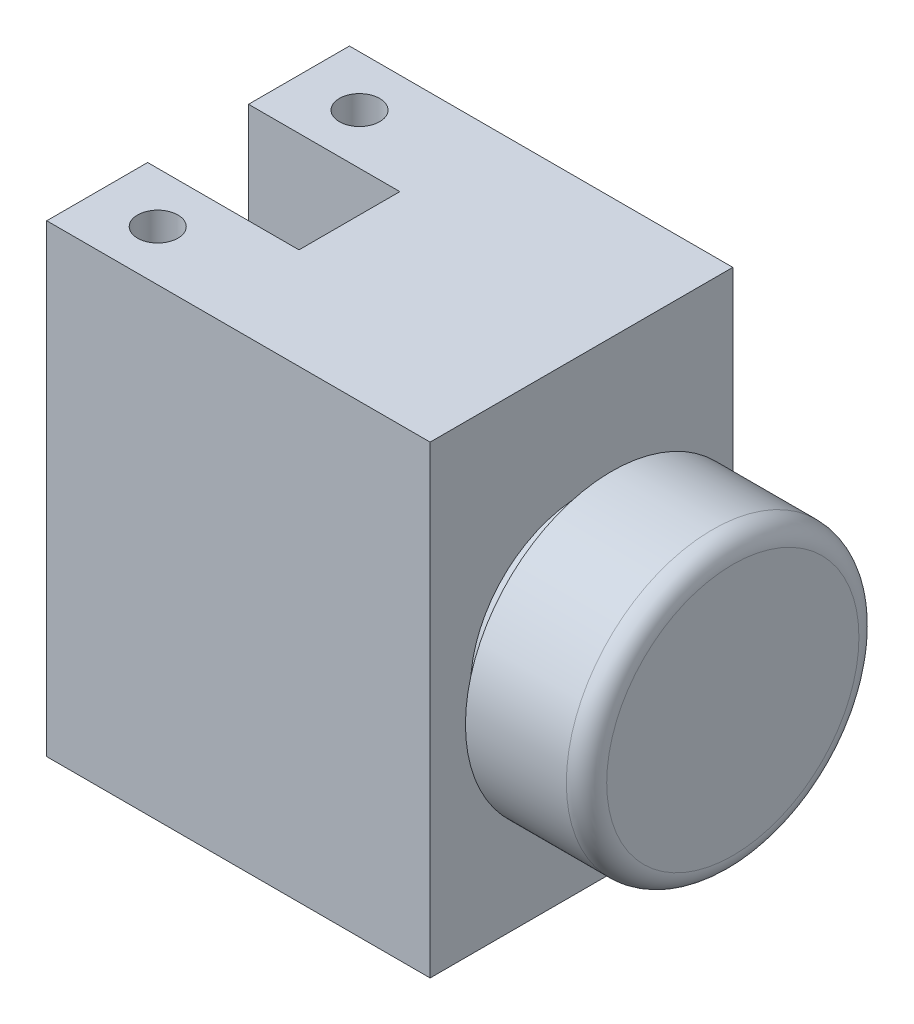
ISO-10303-21;
HEADER;
FILE_DESCRIPTION(('STEP AP214'),'2;1');
FILE_NAME('part.step','',(''),(''),'','','');
FILE_SCHEMA(('AUTOMOTIVE_DESIGN { 1 0 10303 214 1 1 1 1 }'));
ENDSEC;
DATA;
#1=APPLICATION_CONTEXT('core data for automotive mechanical design processes');
#2=APPLICATION_PROTOCOL_DEFINITION('international standard','automotive_design',2000,#1);
#3=PRODUCT_CONTEXT('',#1,'mechanical');
#4=PRODUCT('Part','Part','',(#3));
#5=PRODUCT_RELATED_PRODUCT_CATEGORY('part','',(#4));
#6=PRODUCT_DEFINITION_FORMATION('','',#4);
#7=PRODUCT_DEFINITION_CONTEXT('part definition',#1,'design');
#8=PRODUCT_DEFINITION('design','',#6,#7);
#9=PRODUCT_DEFINITION_SHAPE('','',#8);
#10=(LENGTH_UNIT() NAMED_UNIT(*) SI_UNIT(.MILLI.,.METRE.));
#11=(NAMED_UNIT(*) PLANE_ANGLE_UNIT() SI_UNIT($,.RADIAN.));
#12=(NAMED_UNIT(*) SI_UNIT($,.STERADIAN.) SOLID_ANGLE_UNIT());
#13=UNCERTAINTY_MEASURE_WITH_UNIT(LENGTH_MEASURE(1.E-05),#10,'distance_accuracy_value','');
#14=(GEOMETRIC_REPRESENTATION_CONTEXT(3) GLOBAL_UNCERTAINTY_ASSIGNED_CONTEXT((#13)) GLOBAL_UNIT_ASSIGNED_CONTEXT((#10,
#11,#12)) REPRESENTATION_CONTEXT('',''));
#15=CARTESIAN_POINT('',(0.,0.,0.));
#16=DIRECTION('',(0.,0.,1.));
#17=DIRECTION('',(1.,0.,0.));
#18=AXIS2_PLACEMENT_3D('',#15,#16,#17);
#19=CARTESIAN_POINT('',(12.,0.,0.));
#20=DIRECTION('',(-1.,0.,0.));
#21=DIRECTION('',(0.,0.,1.));
#22=AXIS2_PLACEMENT_3D('',#19,#20,#21);
#23=PLANE('',#22);
#24=CARTESIAN_POINT('',(12.,0.,0.));
#25=DIRECTION('',(-1.,0.,0.));
#26=DIRECTION('',(0.,0.,-1.));
#27=AXIS2_PLACEMENT_3D('',#24,#25,#26);
#28=CIRCLE('',#27,12.5);
#29=CARTESIAN_POINT('',(12.,0.,-12.5));
#30=VERTEX_POINT('',#29);
#31=CARTESIAN_POINT('',(12.,0.,12.5));
#32=VERTEX_POINT('',#31);
#33=EDGE_CURVE('E86',#30,#32,#28,.T.);
#34=ORIENTED_EDGE('',*,*,#33,.F.);
#35=CARTESIAN_POINT('',(12.,0.,0.));
#36=DIRECTION('',(-1.,0.,0.));
#37=DIRECTION('',(0.,0.,1.));
#38=AXIS2_PLACEMENT_3D('',#35,#36,#37);
#39=CIRCLE('',#38,12.5);
#40=EDGE_CURVE('E88',#32,#30,#39,.T.);
#41=ORIENTED_EDGE('',*,*,#40,.F.);
#42=EDGE_LOOP('',(#34,#41));
#43=FACE_BOUND('',#42,.T.);
#44=ADVANCED_FACE('F16',(#43),#23,.F.);
#45=CARTESIAN_POINT('',(10.,0.,0.));
#46=DIRECTION('',(-1.,0.,0.));
#47=DIRECTION('',(0.,0.,1.));
#48=AXIS2_PLACEMENT_3D('',#45,#46,#47);
#49=TOROIDAL_SURFACE('',#48,12.5,2.);
#50=CARTESIAN_POINT('',(10.,0.,0.));
#51=DIRECTION('',(-1.,0.,0.));
#52=DIRECTION('',(0.,0.,1.));
#53=AXIS2_PLACEMENT_3D('',#50,#51,#52);
#54=CIRCLE('',#53,14.5);
#55=CARTESIAN_POINT('',(10.,0.,14.5));
#56=VERTEX_POINT('',#55);
#57=EDGE_CURVE('E93',#56,#56,#54,.T.);
#58=ORIENTED_EDGE('',*,*,#57,.F.);
#59=EDGE_LOOP('',(#58));
#60=FACE_BOUND('',#59,.T.);
#61=ORIENTED_EDGE('',*,*,#40,.T.);
#62=ORIENTED_EDGE('',*,*,#33,.T.);
#63=EDGE_LOOP('',(#61,#62));
#64=FACE_BOUND('',#63,.T.);
#65=ADVANCED_FACE('F90',(#60,#64),#49,.T.);
#66=CARTESIAN_POINT('',(-6.27555773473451,0.,0.));
#67=DIRECTION('',(-1.,0.,0.));
#68=DIRECTION('',(0.,0.,1.));
#69=AXIS2_PLACEMENT_3D('',#66,#67,#68);
#70=CYLINDRICAL_SURFACE('',#69,14.5);
#71=CARTESIAN_POINT('',(0.,0.,0.));
#72=DIRECTION('',(-1.,0.,0.));
#73=DIRECTION('',(0.,0.,1.));
#74=AXIS2_PLACEMENT_3D('',#71,#72,#73);
#75=CIRCLE('',#74,14.5);
#76=CARTESIAN_POINT('',(0.,0.,14.5));
#77=VERTEX_POINT('',#76);
#78=EDGE_CURVE('E155',#77,#77,#75,.F.);
#79=ORIENTED_EDGE('',*,*,#78,.T.);
#80=EDGE_LOOP('',(#79));
#81=FACE_BOUND('',#80,.T.);
#82=ORIENTED_EDGE('',*,*,#57,.T.);
#83=EDGE_LOOP('',(#82));
#84=FACE_BOUND('',#83,.T.);
#85=ADVANCED_FACE('F119',(#81,#84),#70,.T.);
#86=CARTESIAN_POINT('',(0.,14.5,0.));
#87=DIRECTION('',(1.,0.,0.));
#88=DIRECTION('',(0.,0.,-1.));
#89=AXIS2_PLACEMENT_3D('',#86,#87,#88);
#90=PLANE('',#89);
#91=ORIENTED_EDGE('',*,*,#78,.F.);
#92=EDGE_LOOP('',(#91));
#93=FACE_BOUND('',#92,.T.);
#94=CARTESIAN_POINT('',(0.,0.,0.));
#95=DIRECTION('',(-1.,0.,0.));
#96=DIRECTION('',(0.,0.,1.));
#97=AXIS2_PLACEMENT_3D('',#94,#95,#96);
#98=CIRCLE('',#97,11.);
#99=CARTESIAN_POINT('',(0.,0.,11.));
#100=VERTEX_POINT('',#99);
#101=EDGE_CURVE('E151',#100,#100,#98,.T.);
#102=ORIENTED_EDGE('',*,*,#101,.F.);
#103=EDGE_LOOP('',(#102));
#104=FACE_BOUND('',#103,.T.);
#105=ADVANCED_FACE('F166',(#93,#104),#90,.F.);
#106=CARTESIAN_POINT('',(-35.,-23.,10.));
#107=DIRECTION('',(0.,1.,0.));
#108=DIRECTION('',(0.,0.,1.));
#109=AXIS2_PLACEMENT_3D('',#106,#107,#108);
#110=CYLINDRICAL_SURFACE('',#109,2.);
#111=CARTESIAN_POINT('',(-35.,-23.,10.));
#112=DIRECTION('',(0.,1.,0.));
#113=DIRECTION('',(0.,0.,1.));
#114=AXIS2_PLACEMENT_3D('',#111,#112,#113);
#115=CIRCLE('',#114,2.);
#116=CARTESIAN_POINT('',(-35.,-23.,12.));
#117=VERTEX_POINT('',#116);
#118=EDGE_CURVE('E148',#117,#117,#115,.F.);
#119=ORIENTED_EDGE('',*,*,#118,.T.);
#120=EDGE_LOOP('',(#119));
#121=FACE_BOUND('',#120,.T.);
#122=CARTESIAN_POINT('',(-35.,23.,10.));
#123=DIRECTION('',(0.,1.,0.));
#124=DIRECTION('',(0.,0.,1.));
#125=AXIS2_PLACEMENT_3D('',#122,#123,#124);
#126=CIRCLE('',#125,2.);
#127=CARTESIAN_POINT('',(-35.,23.,12.));
#128=VERTEX_POINT('',#127);
#129=EDGE_CURVE('E140',#128,#128,#126,.T.);
#130=ORIENTED_EDGE('',*,*,#129,.T.);
#131=EDGE_LOOP('',(#130));
#132=FACE_BOUND('',#131,.T.);
#133=ADVANCED_FACE('F171',(#121,#132),#110,.F.);
#134=CARTESIAN_POINT('',(-35.,-23.,-10.));
#135=DIRECTION('',(0.,1.,0.));
#136=DIRECTION('',(0.,0.,1.));
#137=AXIS2_PLACEMENT_3D('',#134,#135,#136);
#138=CYLINDRICAL_SURFACE('',#137,2.);
#139=CARTESIAN_POINT('',(-35.,-23.,-10.));
#140=DIRECTION('',(0.,1.,0.));
#141=DIRECTION('',(0.,0.,1.));
#142=AXIS2_PLACEMENT_3D('',#139,#140,#141);
#143=CIRCLE('',#142,2.);
#144=CARTESIAN_POINT('',(-35.,-23.,-8.));
#145=VERTEX_POINT('',#144);
#146=EDGE_CURVE('E144',#145,#145,#143,.F.);
#147=ORIENTED_EDGE('',*,*,#146,.T.);
#148=EDGE_LOOP('',(#147));
#149=FACE_BOUND('',#148,.T.);
#150=CARTESIAN_POINT('',(-35.,23.,-10.));
#151=DIRECTION('',(0.,1.,0.));
#152=DIRECTION('',(0.,0.,1.));
#153=AXIS2_PLACEMENT_3D('',#150,#151,#152);
#154=CIRCLE('',#153,2.);
#155=CARTESIAN_POINT('',(-35.,23.,-8.));
#156=VERTEX_POINT('',#155);
#157=EDGE_CURVE('E136',#156,#156,#154,.T.);
#158=ORIENTED_EDGE('',*,*,#157,.T.);
#159=EDGE_LOOP('',(#158));
#160=FACE_BOUND('',#159,.T.);
#161=ADVANCED_FACE('F220',(#149,#160),#138,.F.);
#162=CARTESIAN_POINT('',(-41.,-23.,5.));
#163=DIRECTION('',(0.,0.,1.));
#164=DIRECTION('',(1.,0.,0.));
#165=AXIS2_PLACEMENT_3D('',#162,#163,#164);
#166=PLANE('',#165);
#167=DIRECTION('',(0.,1.,0.));
#168=VECTOR('',#167,1.);
#169=CARTESIAN_POINT('',(-26.,-23.,5.));
#170=LINE('',#169,#168);
#171=CARTESIAN_POINT('',(-26.,23.,5.));
#172=VERTEX_POINT('',#171);
#173=CARTESIAN_POINT('',(-26.,-23.,5.));
#174=VERTEX_POINT('',#173);
#175=EDGE_CURVE('E157',#172,#174,#170,.F.);
#176=ORIENTED_EDGE('',*,*,#175,.T.);
#177=DIRECTION('',(1.,0.,0.));
#178=VECTOR('',#177,1.);
#179=CARTESIAN_POINT('',(-41.,-23.,5.));
#180=LINE('',#179,#178);
#181=CARTESIAN_POINT('',(-41.,-23.,5.));
#182=VERTEX_POINT('',#181);
#183=EDGE_CURVE('E147',#174,#182,#180,.F.);
#184=ORIENTED_EDGE('',*,*,#183,.T.);
#185=DIRECTION('',(0.,1.,0.));
#186=VECTOR('',#185,1.);
#187=CARTESIAN_POINT('',(-41.,-23.,5.));
#188=LINE('',#187,#186);
#189=CARTESIAN_POINT('',(-41.,23.,5.));
#190=VERTEX_POINT('',#189);
#191=EDGE_CURVE('E394',#190,#182,#188,.F.);
#192=ORIENTED_EDGE('',*,*,#191,.F.);
#193=DIRECTION('',(1.,0.,0.));
#194=VECTOR('',#193,1.);
#195=CARTESIAN_POINT('',(-41.,23.,5.));
#196=LINE('',#195,#194);
#197=EDGE_CURVE('E387',#190,#172,#196,.T.);
#198=ORIENTED_EDGE('',*,*,#197,.T.);
#199=EDGE_LOOP('',(#176,#184,#192,#198));
#200=FACE_BOUND('',#199,.T.);
#201=ADVANCED_FACE('F216',(#200),#166,.F.);
#202=CARTESIAN_POINT('',(-26.,-23.,-5.));
#203=DIRECTION('',(1.,0.,0.));
#204=DIRECTION('',(0.,0.,-1.));
#205=AXIS2_PLACEMENT_3D('',#202,#203,#204);
#206=PLANE('',#205);
#207=DIRECTION('',(0.,1.,0.));
#208=VECTOR('',#207,1.);
#209=CARTESIAN_POINT('',(-26.,-23.,-5.));
#210=LINE('',#209,#208);
#211=CARTESIAN_POINT('',(-26.,23.,-5.));
#212=VERTEX_POINT('',#211);
#213=CARTESIAN_POINT('',(-26.,-23.,-5.));
#214=VERTEX_POINT('',#213);
#215=EDGE_CURVE('E161',#212,#214,#210,.F.);
#216=ORIENTED_EDGE('',*,*,#215,.T.);
#217=DIRECTION('',(0.,0.,1.));
#218=VECTOR('',#217,1.);
#219=CARTESIAN_POINT('',(-26.,-23.,-15.));
#220=LINE('',#219,#218);
#221=EDGE_CURVE('E391',#214,#174,#220,.T.);
#222=ORIENTED_EDGE('',*,*,#221,.T.);
#223=ORIENTED_EDGE('',*,*,#175,.F.);
#224=DIRECTION('',(0.,0.,-1.));
#225=VECTOR('',#224,1.);
#226=CARTESIAN_POINT('',(-26.,23.,-15.));
#227=LINE('',#226,#225);
#228=EDGE_CURVE('E420',#172,#212,#227,.T.);
#229=ORIENTED_EDGE('',*,*,#228,.T.);
#230=EDGE_LOOP('',(#216,#222,#223,#229));
#231=FACE_BOUND('',#230,.T.);
#232=ADVANCED_FACE('F212',(#231),#206,.F.);
#233=CARTESIAN_POINT('',(-41.,-23.,-5.));
#234=DIRECTION('',(0.,0.,-1.));
#235=DIRECTION('',(-1.,0.,0.));
#236=AXIS2_PLACEMENT_3D('',#233,#234,#235);
#237=PLANE('',#236);
#238=DIRECTION('',(0.,1.,0.));
#239=VECTOR('',#238,1.);
#240=CARTESIAN_POINT('',(-41.,-23.,-5.));
#241=LINE('',#240,#239);
#242=CARTESIAN_POINT('',(-41.,-23.,-5.));
#243=VERTEX_POINT('',#242);
#244=CARTESIAN_POINT('',(-41.,23.,-5.));
#245=VERTEX_POINT('',#244);
#246=EDGE_CURVE('E409',#243,#245,#241,.T.);
#247=ORIENTED_EDGE('',*,*,#246,.F.);
#248=DIRECTION('',(1.,0.,0.));
#249=VECTOR('',#248,1.);
#250=CARTESIAN_POINT('',(-41.,-23.,-5.));
#251=LINE('',#250,#249);
#252=EDGE_CURVE('E395',#243,#214,#251,.T.);
#253=ORIENTED_EDGE('',*,*,#252,.T.);
#254=ORIENTED_EDGE('',*,*,#215,.F.);
#255=DIRECTION('',(1.,0.,0.));
#256=VECTOR('',#255,1.);
#257=CARTESIAN_POINT('',(-41.,23.,-5.));
#258=LINE('',#257,#256);
#259=EDGE_CURVE('E418',#212,#245,#258,.F.);
#260=ORIENTED_EDGE('',*,*,#259,.T.);
#261=EDGE_LOOP('',(#247,#253,#254,#260));
#262=FACE_BOUND('',#261,.T.);
#263=ADVANCED_FACE('F208',(#262),#237,.F.);
#264=CARTESIAN_POINT('',(-41.,-23.,15.));
#265=DIRECTION('',(-1.,0.,0.));
#266=DIRECTION('',(0.,0.,1.));
#267=AXIS2_PLACEMENT_3D('',#264,#265,#266);
#268=PLANE('',#267);
#269=DIRECTION('',(0.,-1.,0.));
#270=VECTOR('',#269,1.);
#271=CARTESIAN_POINT('',(-41.,23.,-15.));
#272=LINE('',#271,#270);
#273=CARTESIAN_POINT('',(-41.,23.,-15.));
#274=VERTEX_POINT('',#273);
#275=CARTESIAN_POINT('',(-41.,-23.,-15.));
#276=VERTEX_POINT('',#275);
#277=EDGE_CURVE('E154',#274,#276,#272,.T.);
#278=ORIENTED_EDGE('',*,*,#277,.T.);
#279=DIRECTION('',(0.,0.,1.));
#280=VECTOR('',#279,1.);
#281=CARTESIAN_POINT('',(-41.,-23.,-15.));
#282=LINE('',#281,#280);
#283=EDGE_CURVE('E398',#276,#243,#282,.T.);
#284=ORIENTED_EDGE('',*,*,#283,.T.);
#285=ORIENTED_EDGE('',*,*,#246,.T.);
#286=DIRECTION('',(0.,0.,-1.));
#287=VECTOR('',#286,1.);
#288=CARTESIAN_POINT('',(-41.,23.,-15.));
#289=LINE('',#288,#287);
#290=EDGE_CURVE('E413',#245,#274,#289,.T.);
#291=ORIENTED_EDGE('',*,*,#290,.T.);
#292=EDGE_LOOP('',(#278,#284,#285,#291));
#293=FACE_BOUND('',#292,.T.);
#294=ADVANCED_FACE('F204',(#293),#268,.T.);
#295=CARTESIAN_POINT('',(-41.,23.,-15.));
#296=DIRECTION('',(0.,0.,1.));
#297=DIRECTION('',(0.,-1.,0.));
#298=AXIS2_PLACEMENT_3D('',#295,#296,#297);
#299=PLANE('',#298);
#300=DIRECTION('',(1.,0.,0.));
#301=VECTOR('',#300,1.);
#302=CARTESIAN_POINT('',(-41.,-23.,-15.));
#303=LINE('',#302,#301);
#304=CARTESIAN_POINT('',(-3.,-23.,-15.));
#305=VERTEX_POINT('',#304);
#306=EDGE_CURVE('E404',#305,#276,#303,.F.);
#307=ORIENTED_EDGE('',*,*,#306,.T.);
#308=ORIENTED_EDGE('',*,*,#277,.F.);
#309=DIRECTION('',(1.,0.,0.));
#310=VECTOR('',#309,1.);
#311=CARTESIAN_POINT('',(-41.,23.,-15.));
#312=LINE('',#311,#310);
#313=CARTESIAN_POINT('',(-3.,23.,-15.));
#314=VERTEX_POINT('',#313);
#315=EDGE_CURVE('E139',#274,#314,#312,.T.);
#316=ORIENTED_EDGE('',*,*,#315,.T.);
#317=DIRECTION('',(0.,1.,0.));
#318=VECTOR('',#317,1.);
#319=CARTESIAN_POINT('',(-3.,-23.,-15.));
#320=LINE('',#319,#318);
#321=EDGE_CURVE('E441',#314,#305,#320,.F.);
#322=ORIENTED_EDGE('',*,*,#321,.T.);
#323=EDGE_LOOP('',(#307,#308,#316,#322));
#324=FACE_BOUND('',#323,.T.);
#325=ADVANCED_FACE('F200',(#324),#299,.F.);
#326=CARTESIAN_POINT('',(-6.27555773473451,0.,0.));
#327=DIRECTION('',(-1.,0.,0.));
#328=DIRECTION('',(0.,0.,1.));
#329=AXIS2_PLACEMENT_3D('',#326,#327,#328);
#330=CYLINDRICAL_SURFACE('',#329,11.);
#331=CARTESIAN_POINT('',(-3.,0.,0.));
#332=DIRECTION('',(-1.,0.,0.));
#333=DIRECTION('',(0.,0.,1.));
#334=AXIS2_PLACEMENT_3D('',#331,#332,#333);
#335=CIRCLE('',#334,11.);
#336=CARTESIAN_POINT('',(-3.,0.,11.));
#337=VERTEX_POINT('',#336);
#338=EDGE_CURVE('E126',#337,#337,#335,.F.);
#339=ORIENTED_EDGE('',*,*,#338,.T.);
#340=EDGE_LOOP('',(#339));
#341=FACE_BOUND('',#340,.T.);
#342=ORIENTED_EDGE('',*,*,#101,.T.);
#343=EDGE_LOOP('',(#342));
#344=FACE_BOUND('',#343,.T.);
#345=ADVANCED_FACE('F196',(#341,#344),#330,.T.);
#346=CARTESIAN_POINT('',(-41.,-23.,-15.));
#347=DIRECTION('',(0.,1.,0.));
#348=DIRECTION('',(0.,0.,1.));
#349=AXIS2_PLACEMENT_3D('',#346,#347,#348);
#350=PLANE('',#349);
#351=ORIENTED_EDGE('',*,*,#252,.F.);
#352=ORIENTED_EDGE('',*,*,#283,.F.);
#353=ORIENTED_EDGE('',*,*,#306,.F.);
#354=DIRECTION('',(0.,0.,1.));
#355=VECTOR('',#354,1.);
#356=CARTESIAN_POINT('',(-3.,-23.,15.));
#357=LINE('',#356,#355);
#358=CARTESIAN_POINT('',(-3.,-23.,15.));
#359=VERTEX_POINT('',#358);
#360=EDGE_CURVE('E135',#305,#359,#357,.T.);
#361=ORIENTED_EDGE('',*,*,#360,.T.);
#362=DIRECTION('',(1.,0.,0.));
#363=VECTOR('',#362,1.);
#364=CARTESIAN_POINT('',(-41.,-23.,15.));
#365=LINE('',#364,#363);
#366=CARTESIAN_POINT('',(-41.,-23.,15.));
#367=VERTEX_POINT('',#366);
#368=EDGE_CURVE('E134',#359,#367,#365,.F.);
#369=ORIENTED_EDGE('',*,*,#368,.T.);
#370=DIRECTION('',(0.,0.,1.));
#371=VECTOR('',#370,1.);
#372=CARTESIAN_POINT('',(-41.,-23.,15.));
#373=LINE('',#372,#371);
#374=EDGE_CURVE('E143',#182,#367,#373,.T.);
#375=ORIENTED_EDGE('',*,*,#374,.F.);
#376=ORIENTED_EDGE('',*,*,#183,.F.);
#377=ORIENTED_EDGE('',*,*,#221,.F.);
#378=EDGE_LOOP('',(#351,#352,#353,#361,#369,#375,#376,#377));
#379=FACE_BOUND('',#378,.T.);
#380=ORIENTED_EDGE('',*,*,#146,.F.);
#381=EDGE_LOOP('',(#380));
#382=FACE_BOUND('',#381,.T.);
#383=ORIENTED_EDGE('',*,*,#118,.F.);
#384=EDGE_LOOP('',(#383));
#385=FACE_BOUND('',#384,.T.);
#386=ADVANCED_FACE('F192',(#379,#382,#385),#350,.F.);
#387=CARTESIAN_POINT('',(-41.,-23.,15.));
#388=DIRECTION('',(-1.,0.,0.));
#389=DIRECTION('',(0.,0.,1.));
#390=AXIS2_PLACEMENT_3D('',#387,#388,#389);
#391=PLANE('',#390);
#392=DIRECTION('',(0.,1.,0.));
#393=VECTOR('',#392,1.);
#394=CARTESIAN_POINT('',(-41.,23.,15.));
#395=LINE('',#394,#393);
#396=CARTESIAN_POINT('',(-41.,23.,15.));
#397=VERTEX_POINT('',#396);
#398=EDGE_CURVE('E431',#367,#397,#395,.T.);
#399=ORIENTED_EDGE('',*,*,#398,.T.);
#400=DIRECTION('',(0.,0.,-1.));
#401=VECTOR('',#400,1.);
#402=CARTESIAN_POINT('',(-41.,23.,-15.));
#403=LINE('',#402,#401);
#404=EDGE_CURVE('E426',#397,#190,#403,.T.);
#405=ORIENTED_EDGE('',*,*,#404,.T.);
#406=ORIENTED_EDGE('',*,*,#191,.T.);
#407=ORIENTED_EDGE('',*,*,#374,.T.);
#408=EDGE_LOOP('',(#399,#405,#406,#407));
#409=FACE_BOUND('',#408,.T.);
#410=ADVANCED_FACE('F188',(#409),#391,.T.);
#411=CARTESIAN_POINT('',(-41.,23.,-15.));
#412=DIRECTION('',(0.,-1.,0.));
#413=DIRECTION('',(0.,0.,-1.));
#414=AXIS2_PLACEMENT_3D('',#411,#412,#413);
#415=PLANE('',#414);
#416=ORIENTED_EDGE('',*,*,#259,.F.);
#417=ORIENTED_EDGE('',*,*,#228,.F.);
#418=ORIENTED_EDGE('',*,*,#197,.F.);
#419=ORIENTED_EDGE('',*,*,#404,.F.);
#420=DIRECTION('',(1.,0.,0.));
#421=VECTOR('',#420,1.);
#422=CARTESIAN_POINT('',(-41.,23.,15.));
#423=LINE('',#422,#421);
#424=CARTESIAN_POINT('',(-3.,23.,15.));
#425=VERTEX_POINT('',#424);
#426=EDGE_CURVE('E27',#397,#425,#423,.T.);
#427=ORIENTED_EDGE('',*,*,#426,.T.);
#428=DIRECTION('',(0.,0.,1.));
#429=VECTOR('',#428,1.);
#430=CARTESIAN_POINT('',(-3.,23.,15.));
#431=LINE('',#430,#429);
#432=EDGE_CURVE('E35',#425,#314,#431,.F.);
#433=ORIENTED_EDGE('',*,*,#432,.T.);
#434=ORIENTED_EDGE('',*,*,#315,.F.);
#435=ORIENTED_EDGE('',*,*,#290,.F.);
#436=EDGE_LOOP('',(#416,#417,#418,#419,#427,#433,#434,#435));
#437=FACE_BOUND('',#436,.T.);
#438=ORIENTED_EDGE('',*,*,#157,.F.);
#439=EDGE_LOOP('',(#438));
#440=FACE_BOUND('',#439,.T.);
#441=ORIENTED_EDGE('',*,*,#129,.F.);
#442=EDGE_LOOP('',(#441));
#443=FACE_BOUND('',#442,.T.);
#444=ADVANCED_FACE('F181',(#437,#440,#443),#415,.F.);
#445=CARTESIAN_POINT('',(-3.,-23.,15.));
#446=DIRECTION('',(-1.,0.,0.));
#447=DIRECTION('',(0.,0.,1.));
#448=AXIS2_PLACEMENT_3D('',#445,#446,#447);
#449=PLANE('',#448);
#450=ORIENTED_EDGE('',*,*,#338,.F.);
#451=EDGE_LOOP('',(#450));
#452=FACE_BOUND('',#451,.T.);
#453=ORIENTED_EDGE('',*,*,#360,.F.);
#454=ORIENTED_EDGE('',*,*,#321,.F.);
#455=ORIENTED_EDGE('',*,*,#432,.F.);
#456=DIRECTION('',(0.,1.,0.));
#457=VECTOR('',#456,1.);
#458=CARTESIAN_POINT('',(-3.,23.,15.));
#459=LINE('',#458,#457);
#460=EDGE_CURVE('E11',#425,#359,#459,.F.);
#461=ORIENTED_EDGE('',*,*,#460,.T.);
#462=EDGE_LOOP('',(#453,#454,#455,#461));
#463=FACE_BOUND('',#462,.T.);
#464=ADVANCED_FACE('F175',(#452,#463),#449,.F.);
#465=CARTESIAN_POINT('',(-41.,23.,15.));
#466=DIRECTION('',(0.,0.,-1.));
#467=DIRECTION('',(0.,1.,0.));
#468=AXIS2_PLACEMENT_3D('',#465,#466,#467);
#469=PLANE('',#468);
#470=ORIENTED_EDGE('',*,*,#426,.F.);
#471=ORIENTED_EDGE('',*,*,#398,.F.);
#472=ORIENTED_EDGE('',*,*,#368,.F.);
#473=ORIENTED_EDGE('',*,*,#460,.F.);
#474=EDGE_LOOP('',(#470,#471,#472,#473));
#475=FACE_BOUND('',#474,.T.);
#476=ADVANCED_FACE('F173',(#475),#469,.F.);
#477=CLOSED_SHELL('',(#44,#65,#85,#105,#133,#161,#201,#232,#263,#294,#325,#345,#386,#410,#444,
#464,#476));
#478=MANIFOLD_SOLID_BREP('B1',#477);
#479=ADVANCED_BREP_SHAPE_REPRESENTATION('',(#18,#478),#14);
#480=SHAPE_DEFINITION_REPRESENTATION(#9,#479);
ENDSEC;
END-ISO-10303-21;
